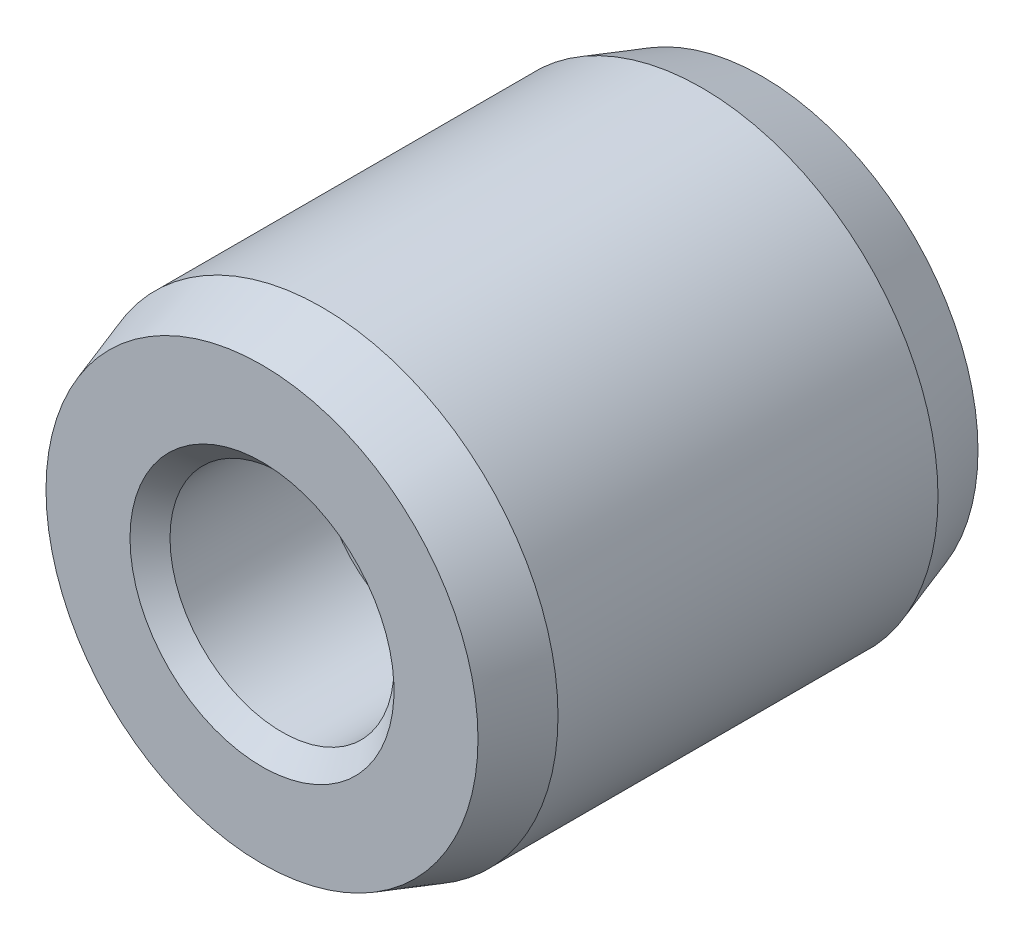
ISO-10303-21;
HEADER;
FILE_DESCRIPTION(('STEP AP214'),'2;1');
FILE_NAME('part.step','',(''),(''),'','','');
FILE_SCHEMA(('AUTOMOTIVE_DESIGN { 1 0 10303 214 1 1 1 1 }'));
ENDSEC;
DATA;
#1=APPLICATION_CONTEXT('core data for automotive mechanical design processes');
#2=APPLICATION_PROTOCOL_DEFINITION('international standard','automotive_design',2000,#1);
#3=PRODUCT_CONTEXT('',#1,'mechanical');
#4=PRODUCT('Part','Part','',(#3));
#5=PRODUCT_RELATED_PRODUCT_CATEGORY('part','',(#4));
#6=PRODUCT_DEFINITION_FORMATION('','',#4);
#7=PRODUCT_DEFINITION_CONTEXT('part definition',#1,'design');
#8=PRODUCT_DEFINITION('design','',#6,#7);
#9=PRODUCT_DEFINITION_SHAPE('','',#8);
#10=(LENGTH_UNIT() NAMED_UNIT(*) SI_UNIT(.MILLI.,.METRE.));
#11=(NAMED_UNIT(*) PLANE_ANGLE_UNIT() SI_UNIT($,.RADIAN.));
#12=(NAMED_UNIT(*) SI_UNIT($,.STERADIAN.) SOLID_ANGLE_UNIT());
#13=UNCERTAINTY_MEASURE_WITH_UNIT(LENGTH_MEASURE(1.E-05),#10,'distance_accuracy_value','');
#14=(GEOMETRIC_REPRESENTATION_CONTEXT(3) GLOBAL_UNCERTAINTY_ASSIGNED_CONTEXT((#13)) GLOBAL_UNIT_ASSIGNED_CONTEXT((#10,
#11,#12)) REPRESENTATION_CONTEXT('',''));
#15=CARTESIAN_POINT('',(0.,0.,0.));
#16=DIRECTION('',(0.,0.,1.));
#17=DIRECTION('',(1.,0.,0.));
#18=AXIS2_PLACEMENT_3D('',#15,#16,#17);
#19=CARTESIAN_POINT('',(0.,2.7432,3.175));
#20=DIRECTION('',(0.,0.,-1.));
#21=DIRECTION('',(-1.,0.,0.));
#22=AXIS2_PLACEMENT_3D('',#19,#20,#21);
#23=PLANE('',#22);
#24=CARTESIAN_POINT('',(0.,0.,3.175));
#25=DIRECTION('',(0.,0.,-1.));
#26=DIRECTION('',(-1.,0.,0.));
#27=AXIS2_PLACEMENT_3D('',#24,#25,#26);
#28=CIRCLE('',#27,1.6764);
#29=CARTESIAN_POINT('',(-1.6764,0.,3.175));
#30=VERTEX_POINT('',#29);
#31=EDGE_CURVE('E10',#30,#30,#28,.T.);
#32=ORIENTED_EDGE('',*,*,#31,.T.);
#33=EDGE_LOOP('',(#32));
#34=FACE_BOUND('',#33,.T.);
#35=CARTESIAN_POINT('',(0.,0.,3.175));
#36=DIRECTION('',(0.,0.,1.));
#37=DIRECTION('',(1.,0.,0.));
#38=AXIS2_PLACEMENT_3D('',#35,#36,#37);
#39=CIRCLE('',#38,2.7432);
#40=CARTESIAN_POINT('',(2.7432,0.,3.175));
#41=VERTEX_POINT('',#40);
#42=EDGE_CURVE('E44',#41,#41,#39,.T.);
#43=ORIENTED_EDGE('',*,*,#42,.T.);
#44=EDGE_LOOP('',(#43));
#45=FACE_BOUND('',#44,.T.);
#46=ADVANCED_FACE('F15',(#34,#45),#23,.F.);
#47=CARTESIAN_POINT('',(0.,0.,-3.175));
#48=DIRECTION('',(0.,0.,1.));
#49=DIRECTION('',(1.,0.,0.));
#50=AXIS2_PLACEMENT_3D('',#47,#48,#49);
#51=PLANE('',#50);
#52=CARTESIAN_POINT('',(0.,0.,-3.175));
#53=DIRECTION('',(0.,0.,1.));
#54=DIRECTION('',(1.,0.,0.));
#55=AXIS2_PLACEMENT_3D('',#52,#53,#54);
#56=CIRCLE('',#55,1.6764);
#57=CARTESIAN_POINT('',(1.6764,0.,-3.175));
#58=VERTEX_POINT('',#57);
#59=EDGE_CURVE('E26',#58,#58,#56,.T.);
#60=ORIENTED_EDGE('',*,*,#59,.T.);
#61=EDGE_LOOP('',(#60));
#62=FACE_BOUND('',#61,.T.);
#63=CARTESIAN_POINT('',(0.,0.,-3.175));
#64=DIRECTION('',(0.,0.,1.));
#65=DIRECTION('',(1.,0.,0.));
#66=AXIS2_PLACEMENT_3D('',#63,#64,#65);
#67=CIRCLE('',#66,2.7432);
#68=CARTESIAN_POINT('',(2.7432,0.,-3.175));
#69=VERTEX_POINT('',#68);
#70=EDGE_CURVE('E35',#69,#69,#67,.T.);
#71=ORIENTED_EDGE('',*,*,#70,.F.);
#72=EDGE_LOOP('',(#71));
#73=FACE_BOUND('',#72,.T.);
#74=ADVANCED_FACE('F76',(#62,#73),#51,.F.);
#75=CARTESIAN_POINT('',(0.,0.,-3.175));
#76=DIRECTION('',(0.,0.,1.));
#77=DIRECTION('',(1.,0.,0.));
#78=AXIS2_PLACEMENT_3D('',#75,#76,#77);
#79=CONICAL_SURFACE('',#78,2.7432,0.321750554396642);
#80=CARTESIAN_POINT('',(0.,0.,-2.413));
#81=DIRECTION('',(0.,0.,1.));
#82=DIRECTION('',(1.,0.,0.));
#83=AXIS2_PLACEMENT_3D('',#80,#81,#82);
#84=CIRCLE('',#83,2.9972);
#85=CARTESIAN_POINT('',(2.9972,0.,-2.413));
#86=VERTEX_POINT('',#85);
#87=EDGE_CURVE('E38',#86,#86,#84,.T.);
#88=ORIENTED_EDGE('',*,*,#87,.F.);
#89=EDGE_LOOP('',(#88));
#90=FACE_BOUND('',#89,.T.);
#91=ORIENTED_EDGE('',*,*,#70,.T.);
#92=EDGE_LOOP('',(#91));
#93=FACE_BOUND('',#92,.T.);
#94=ADVANCED_FACE('F81',(#90,#93),#79,.T.);
#95=CARTESIAN_POINT('',(0.,0.,3.175));
#96=DIRECTION('',(0.,0.,1.));
#97=DIRECTION('',(1.,0.,0.));
#98=AXIS2_PLACEMENT_3D('',#95,#96,#97);
#99=CYLINDRICAL_SURFACE('',#98,2.9972);
#100=CARTESIAN_POINT('',(0.,0.,2.413));
#101=DIRECTION('',(0.,0.,1.));
#102=DIRECTION('',(1.,0.,0.));
#103=AXIS2_PLACEMENT_3D('',#100,#101,#102);
#104=CIRCLE('',#103,2.9972);
#105=CARTESIAN_POINT('',(2.9972,0.,2.413));
#106=VERTEX_POINT('',#105);
#107=EDGE_CURVE('E41',#106,#106,#104,.T.);
#108=ORIENTED_EDGE('',*,*,#107,.F.);
#109=EDGE_LOOP('',(#108));
#110=FACE_BOUND('',#109,.T.);
#111=ORIENTED_EDGE('',*,*,#87,.T.);
#112=EDGE_LOOP('',(#111));
#113=FACE_BOUND('',#112,.T.);
#114=ADVANCED_FACE('F88',(#110,#113),#99,.T.);
#115=CARTESIAN_POINT('',(0.,0.,2.413));
#116=DIRECTION('',(0.,0.,-1.));
#117=DIRECTION('',(-1.,0.,0.));
#118=AXIS2_PLACEMENT_3D('',#115,#116,#117);
#119=CONICAL_SURFACE('',#118,2.9972,0.321750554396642);
#120=ORIENTED_EDGE('',*,*,#42,.F.);
#121=EDGE_LOOP('',(#120));
#122=FACE_BOUND('',#121,.T.);
#123=ORIENTED_EDGE('',*,*,#107,.T.);
#124=EDGE_LOOP('',(#123));
#125=FACE_BOUND('',#124,.T.);
#126=ADVANCED_FACE('F92',(#122,#125),#119,.T.);
#127=CARTESIAN_POINT('',(0.,0.,-3.175));
#128=DIRECTION('',(0.,0.,-1.));
#129=DIRECTION('',(-1.,0.,0.));
#130=AXIS2_PLACEMENT_3D('',#127,#128,#129);
#131=CYLINDRICAL_SURFACE('',#130,1.1303);
#132=CARTESIAN_POINT('',(0.,0.,1.016));
#133=DIRECTION('',(0.,0.,1.));
#134=DIRECTION('',(1.,0.,0.));
#135=AXIS2_PLACEMENT_3D('',#132,#133,#134);
#136=CIRCLE('',#135,1.1303);
#137=CARTESIAN_POINT('',(1.1303,0.,1.016));
#138=VERTEX_POINT('',#137);
#139=EDGE_CURVE('E53',#138,#138,#136,.T.);
#140=ORIENTED_EDGE('',*,*,#139,.T.);
#141=EDGE_LOOP('',(#140));
#142=FACE_BOUND('',#141,.T.);
#143=CARTESIAN_POINT('',(0.,0.,-1.016));
#144=DIRECTION('',(0.,0.,-1.));
#145=DIRECTION('',(-1.,0.,0.));
#146=AXIS2_PLACEMENT_3D('',#143,#144,#145);
#147=CIRCLE('',#146,1.1303);
#148=CARTESIAN_POINT('',(-1.1303,0.,-1.016));
#149=VERTEX_POINT('',#148);
#150=EDGE_CURVE('E47',#149,#149,#147,.T.);
#151=ORIENTED_EDGE('',*,*,#150,.T.);
#152=EDGE_LOOP('',(#151));
#153=FACE_BOUND('',#152,.T.);
#154=ADVANCED_FACE('F96',(#142,#153),#131,.F.);
#155=CARTESIAN_POINT('',(1.1303,0.,-1.016));
#156=DIRECTION('',(0.,0.,1.));
#157=DIRECTION('',(1.,0.,0.));
#158=AXIS2_PLACEMENT_3D('',#155,#156,#157);
#159=PLANE('',#158);
#160=ORIENTED_EDGE('',*,*,#150,.F.);
#161=EDGE_LOOP('',(#160));
#162=FACE_BOUND('',#161,.T.);
#163=CARTESIAN_POINT('',(0.,0.,-1.016));
#164=DIRECTION('',(0.,0.,-1.));
#165=DIRECTION('',(-1.,0.,0.));
#166=AXIS2_PLACEMENT_3D('',#163,#164,#165);
#167=CIRCLE('',#166,1.4224);
#168=CARTESIAN_POINT('',(-1.4224,0.,-1.016));
#169=VERTEX_POINT('',#168);
#170=EDGE_CURVE('E50',#169,#169,#167,.T.);
#171=ORIENTED_EDGE('',*,*,#170,.T.);
#172=EDGE_LOOP('',(#171));
#173=FACE_BOUND('',#172,.T.);
#174=ADVANCED_FACE('F100',(#162,#173),#159,.F.);
#175=CARTESIAN_POINT('',(0.,0.,-3.175));
#176=DIRECTION('',(0.,0.,-1.));
#177=DIRECTION('',(-1.,0.,0.));
#178=AXIS2_PLACEMENT_3D('',#175,#176,#177);
#179=CYLINDRICAL_SURFACE('',#178,1.4224);
#180=CARTESIAN_POINT('',(0.,0.,-2.921));
#181=DIRECTION('',(0.,0.,1.));
#182=DIRECTION('',(1.,0.,0.));
#183=AXIS2_PLACEMENT_3D('',#180,#181,#182);
#184=CIRCLE('',#183,1.4224);
#185=CARTESIAN_POINT('',(1.4224,0.,-2.921));
#186=VERTEX_POINT('',#185);
#187=EDGE_CURVE('E30',#186,#186,#184,.F.);
#188=ORIENTED_EDGE('',*,*,#187,.T.);
#189=EDGE_LOOP('',(#188));
#190=FACE_BOUND('',#189,.T.);
#191=ORIENTED_EDGE('',*,*,#170,.F.);
#192=EDGE_LOOP('',(#191));
#193=FACE_BOUND('',#192,.T.);
#194=ADVANCED_FACE('F72',(#190,#193),#179,.F.);
#195=CARTESIAN_POINT('',(1.1303,0.,1.016));
#196=DIRECTION('',(0.,0.,-1.));
#197=DIRECTION('',(-1.,0.,0.));
#198=AXIS2_PLACEMENT_3D('',#195,#196,#197);
#199=PLANE('',#198);
#200=ORIENTED_EDGE('',*,*,#139,.F.);
#201=EDGE_LOOP('',(#200));
#202=FACE_BOUND('',#201,.T.);
#203=CARTESIAN_POINT('',(0.,0.,1.016));
#204=DIRECTION('',(0.,0.,1.));
#205=DIRECTION('',(1.,0.,0.));
#206=AXIS2_PLACEMENT_3D('',#203,#204,#205);
#207=CIRCLE('',#206,1.4224);
#208=CARTESIAN_POINT('',(1.4224,0.,1.016));
#209=VERTEX_POINT('',#208);
#210=EDGE_CURVE('E56',#209,#209,#207,.T.);
#211=ORIENTED_EDGE('',*,*,#210,.T.);
#212=EDGE_LOOP('',(#211));
#213=FACE_BOUND('',#212,.T.);
#214=ADVANCED_FACE('F60',(#202,#213),#199,.F.);
#215=CARTESIAN_POINT('',(0.,0.,3.175));
#216=DIRECTION('',(0.,0.,1.));
#217=DIRECTION('',(1.,0.,0.));
#218=AXIS2_PLACEMENT_3D('',#215,#216,#217);
#219=CYLINDRICAL_SURFACE('',#218,1.4224);
#220=CARTESIAN_POINT('',(0.,0.,2.921));
#221=DIRECTION('',(0.,0.,-1.));
#222=DIRECTION('',(-1.,0.,0.));
#223=AXIS2_PLACEMENT_3D('',#220,#221,#222);
#224=CIRCLE('',#223,1.4224);
#225=CARTESIAN_POINT('',(-1.4224,0.,2.921));
#226=VERTEX_POINT('',#225);
#227=EDGE_CURVE('E22',#226,#226,#224,.F.);
#228=ORIENTED_EDGE('',*,*,#227,.T.);
#229=EDGE_LOOP('',(#228));
#230=FACE_BOUND('',#229,.T.);
#231=ORIENTED_EDGE('',*,*,#210,.F.);
#232=EDGE_LOOP('',(#231));
#233=FACE_BOUND('',#232,.T.);
#234=ADVANCED_FACE('F62',(#230,#233),#219,.F.);
#235=CARTESIAN_POINT('',(0.,0.,-2.921));
#236=DIRECTION('',(0.,0.,-1.));
#237=DIRECTION('',(-1.,0.,0.));
#238=AXIS2_PLACEMENT_3D('',#235,#236,#237);
#239=CONICAL_SURFACE('',#238,1.4224,0.785398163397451);
#240=ORIENTED_EDGE('',*,*,#59,.F.);
#241=EDGE_LOOP('',(#240));
#242=FACE_BOUND('',#241,.T.);
#243=ORIENTED_EDGE('',*,*,#187,.F.);
#244=EDGE_LOOP('',(#243));
#245=FACE_BOUND('',#244,.T.);
#246=ADVANCED_FACE('F64',(#242,#245),#239,.F.);
#247=CARTESIAN_POINT('',(0.,0.,2.921));
#248=DIRECTION('',(0.,0.,1.));
#249=DIRECTION('',(1.,0.,0.));
#250=AXIS2_PLACEMENT_3D('',#247,#248,#249);
#251=CONICAL_SURFACE('',#250,1.4224,0.785398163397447);
#252=ORIENTED_EDGE('',*,*,#31,.F.);
#253=EDGE_LOOP('',(#252));
#254=FACE_BOUND('',#253,.T.);
#255=ORIENTED_EDGE('',*,*,#227,.F.);
#256=EDGE_LOOP('',(#255));
#257=FACE_BOUND('',#256,.T.);
#258=ADVANCED_FACE('F17',(#254,#257),#251,.F.);
#259=CLOSED_SHELL('',(#46,#74,#94,#114,#126,#154,#174,#194,#214,#234,#246,#258));
#260=MANIFOLD_SOLID_BREP('B1',#259);
#261=ADVANCED_BREP_SHAPE_REPRESENTATION('',(#18,#260),#14);
#262=SHAPE_DEFINITION_REPRESENTATION(#9,#261);
ENDSEC;
END-ISO-10303-21;
